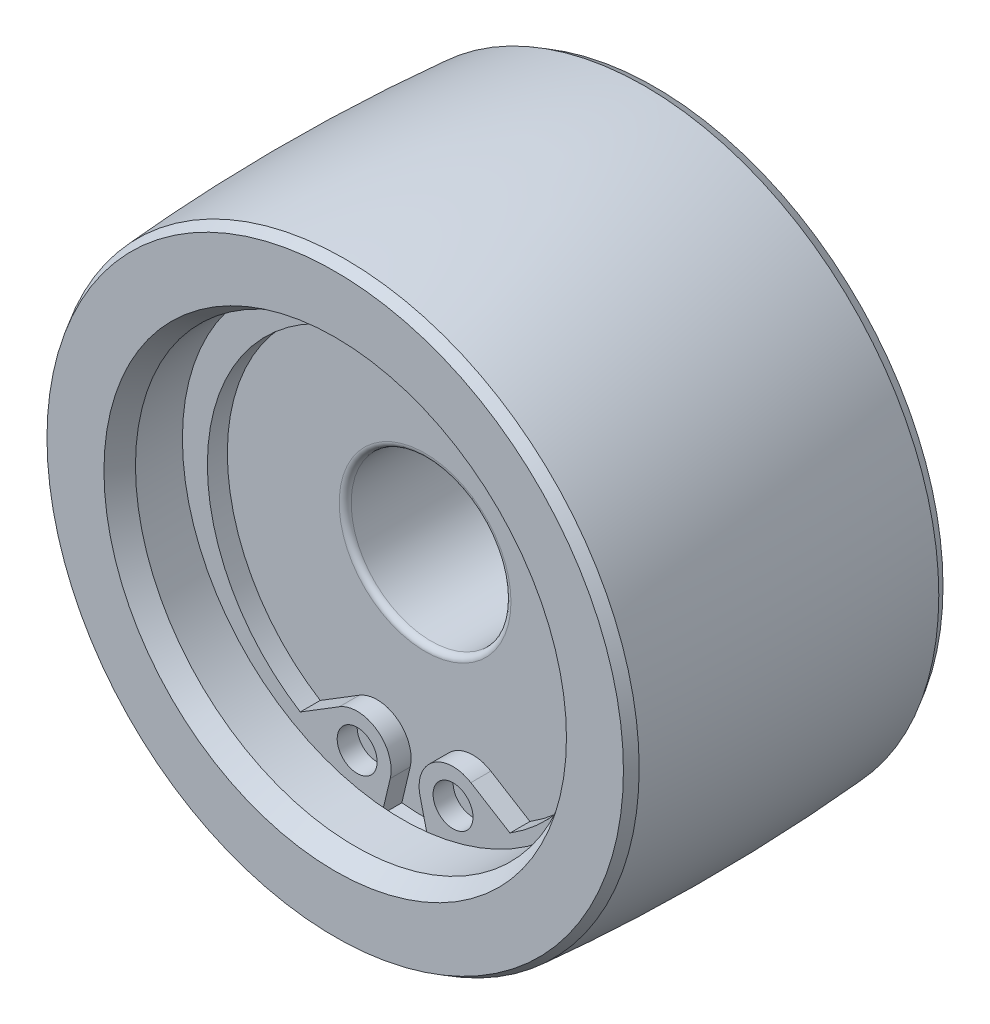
ISO-10303-21;
HEADER;
FILE_DESCRIPTION(('STEP AP214'),'2;1');
FILE_NAME('part.step','',(''),(''),'','','');
FILE_SCHEMA(('AUTOMOTIVE_DESIGN { 1 0 10303 214 1 1 1 1 }'));
ENDSEC;
DATA;
#1=APPLICATION_CONTEXT('core data for automotive mechanical design processes');
#2=APPLICATION_PROTOCOL_DEFINITION('international standard','automotive_design',2000,#1);
#3=PRODUCT_CONTEXT('',#1,'mechanical');
#4=PRODUCT('Part','Part','',(#3));
#5=PRODUCT_RELATED_PRODUCT_CATEGORY('part','',(#4));
#6=PRODUCT_DEFINITION_FORMATION('','',#4);
#7=PRODUCT_DEFINITION_CONTEXT('part definition',#1,'design');
#8=PRODUCT_DEFINITION('design','',#6,#7);
#9=PRODUCT_DEFINITION_SHAPE('','',#8);
#10=(LENGTH_UNIT() NAMED_UNIT(*) SI_UNIT(.MILLI.,.METRE.));
#11=(NAMED_UNIT(*) PLANE_ANGLE_UNIT() SI_UNIT($,.RADIAN.));
#12=(NAMED_UNIT(*) SI_UNIT($,.STERADIAN.) SOLID_ANGLE_UNIT());
#13=UNCERTAINTY_MEASURE_WITH_UNIT(LENGTH_MEASURE(1.E-05),#10,'distance_accuracy_value','');
#14=(GEOMETRIC_REPRESENTATION_CONTEXT(3) GLOBAL_UNCERTAINTY_ASSIGNED_CONTEXT((#13)) GLOBAL_UNIT_ASSIGNED_CONTEXT((#10,
#11,#12)) REPRESENTATION_CONTEXT('',''));
#15=CARTESIAN_POINT('',(0.,0.,0.));
#16=DIRECTION('',(0.,0.,1.));
#17=DIRECTION('',(1.,0.,0.));
#18=AXIS2_PLACEMENT_3D('',#15,#16,#17);
#19=CARTESIAN_POINT('',(0.,0.,-6.9999999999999));
#20=DIRECTION('',(0.,0.,1.));
#21=DIRECTION('',(1.,0.,0.));
#22=AXIS2_PLACEMENT_3D('',#19,#20,#21);
#23=CONICAL_SURFACE('',#22,15.0070285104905,0.523598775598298);
#24=CARTESIAN_POINT('',(0.,0.,-7.9999999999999));
#25=DIRECTION('',(0.,0.,-1.));
#26=DIRECTION('',(-1.,0.,0.));
#27=AXIS2_PLACEMENT_3D('',#24,#25,#26);
#28=CIRCLE('',#27,14.4296782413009);
#29=CARTESIAN_POINT('',(-14.4296782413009,0.,-7.9999999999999));
#30=VERTEX_POINT('',#29);
#31=EDGE_CURVE('E197',#30,#30,#28,.T.);
#32=ORIENTED_EDGE('',*,*,#31,.F.);
#33=EDGE_LOOP('',(#32));
#34=FACE_BOUND('',#33,.T.);
#35=CARTESIAN_POINT('',(0.,0.,-7.49999999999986));
#36=DIRECTION('',(0.,0.,-1.));
#37=DIRECTION('',(-1.,0.,0.));
#38=AXIS2_PLACEMENT_3D('',#35,#36,#37);
#39=CIRCLE('',#38,14.7183533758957);
#40=CARTESIAN_POINT('',(-14.7183533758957,0.,-7.49999999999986));
#41=VERTEX_POINT('',#40);
#42=EDGE_CURVE('E200',#41,#41,#39,.F.);
#43=ORIENTED_EDGE('',*,*,#42,.F.);
#44=EDGE_LOOP('',(#43));
#45=FACE_BOUND('',#44,.T.);
#46=ADVANCED_FACE('F14',(#34,#45),#23,.T.);
#47=CARTESIAN_POINT('',(0.,0.,-8.));
#48=DIRECTION('',(0.,0.,1.));
#49=DIRECTION('',(1.,0.,0.));
#50=AXIS2_PLACEMENT_3D('',#47,#48,#49);
#51=PLANE('',#50);
#52=ORIENTED_EDGE('',*,*,#31,.T.);
#53=EDGE_LOOP('',(#52));
#54=FACE_BOUND('',#53,.T.);
#55=CARTESIAN_POINT('',(0.,0.,-8.));
#56=DIRECTION('',(0.,0.,-1.));
#57=DIRECTION('',(-1.,0.,0.));
#58=AXIS2_PLACEMENT_3D('',#55,#56,#57);
#59=CIRCLE('',#58,9.);
#60=CARTESIAN_POINT('',(-9.,0.,-8.));
#61=VERTEX_POINT('',#60);
#62=EDGE_CURVE('E220',#61,#61,#59,.T.);
#63=ORIENTED_EDGE('',*,*,#62,.F.);
#64=EDGE_LOOP('',(#63));
#65=FACE_BOUND('',#64,.T.);
#66=ADVANCED_FACE('F234',(#54,#65),#51,.F.);
#67=CARTESIAN_POINT('',(0.,0.,0.));
#68=DIRECTION('',(0.,0.,-1.));
#69=DIRECTION('',(-1.,0.,0.));
#70=AXIS2_PLACEMENT_3D('',#67,#68,#69);
#71=DEGENERATE_TOROIDAL_SURFACE('',#70,85.,100.,.F.);
#72=ORIENTED_EDGE('',*,*,#42,.T.);
#73=EDGE_LOOP('',(#72));
#74=FACE_BOUND('',#73,.T.);
#75=CARTESIAN_POINT('',(0.,0.,7.5));
#76=DIRECTION('',(0.,0.,1.));
#77=DIRECTION('',(1.,0.,0.));
#78=AXIS2_PLACEMENT_3D('',#75,#76,#77);
#79=CIRCLE('',#78,14.7183533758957);
#80=CARTESIAN_POINT('',(14.7183533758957,0.,7.5));
#81=VERTEX_POINT('',#80);
#82=EDGE_CURVE('E204',#81,#81,#79,.F.);
#83=ORIENTED_EDGE('',*,*,#82,.T.);
#84=EDGE_LOOP('',(#83));
#85=FACE_BOUND('',#84,.T.);
#86=ADVANCED_FACE('F230',(#74,#85),#71,.F.);
#87=CARTESIAN_POINT('',(0.,0.,-8.8));
#88=DIRECTION('',(0.,0.,-1.));
#89=DIRECTION('',(-1.,0.,0.));
#90=AXIS2_PLACEMENT_3D('',#87,#88,#89);
#91=CYLINDRICAL_SURFACE('',#90,9.);
#92=CARTESIAN_POINT('',(0.,0.,-3.5));
#93=DIRECTION('',(0.,0.,-1.));
#94=DIRECTION('',(-1.,0.,0.));
#95=AXIS2_PLACEMENT_3D('',#92,#93,#94);
#96=CIRCLE('',#95,9.);
#97=CARTESIAN_POINT('',(-9.,0.,-3.5));
#98=VERTEX_POINT('',#97);
#99=EDGE_CURVE('E130',#98,#98,#96,.T.);
#100=ORIENTED_EDGE('',*,*,#99,.F.);
#101=EDGE_LOOP('',(#100));
#102=FACE_BOUND('',#101,.T.);
#103=ORIENTED_EDGE('',*,*,#62,.T.);
#104=EDGE_LOOP('',(#103));
#105=FACE_BOUND('',#104,.T.);
#106=ADVANCED_FACE('F508',(#102,#105),#91,.F.);
#107=CARTESIAN_POINT('',(0.,0.,8.));
#108=DIRECTION('',(0.,0.,-1.));
#109=DIRECTION('',(-1.,0.,0.));
#110=AXIS2_PLACEMENT_3D('',#107,#108,#109);
#111=CONICAL_SURFACE('',#110,14.4296782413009,0.523598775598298);
#112=CARTESIAN_POINT('',(0.,0.,8.));
#113=DIRECTION('',(0.,0.,-1.));
#114=DIRECTION('',(-1.,0.,0.));
#115=AXIS2_PLACEMENT_3D('',#112,#113,#114);
#116=CIRCLE('',#115,14.4296782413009);
#117=CARTESIAN_POINT('',(-14.4296782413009,0.,8.));
#118=VERTEX_POINT('',#117);
#119=EDGE_CURVE('E201',#118,#118,#116,.T.);
#120=ORIENTED_EDGE('',*,*,#119,.T.);
#121=EDGE_LOOP('',(#120));
#122=FACE_BOUND('',#121,.T.);
#123=ORIENTED_EDGE('',*,*,#82,.F.);
#124=EDGE_LOOP('',(#123));
#125=FACE_BOUND('',#124,.T.);
#126=ADVANCED_FACE('F289',(#122,#125),#111,.T.);
#127=CARTESIAN_POINT('',(0.,4.9085760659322,-3.50000000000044));
#128=DIRECTION('',(0.,0.,-1.));
#129=DIRECTION('',(-1.,0.,0.));
#130=AXIS2_PLACEMENT_3D('',#127,#128,#129);
#131=PLANE('',#130);
#132=CARTESIAN_POINT('',(0.,0.,-3.50000000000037));
#133=DIRECTION('',(0.,0.,1.));
#134=DIRECTION('',(1.,0.,0.));
#135=AXIS2_PLACEMENT_3D('',#132,#133,#134);
#136=CIRCLE('',#135,4.3);
#137=CARTESIAN_POINT('',(4.3,0.,-3.50000000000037));
#138=VERTEX_POINT('',#137);
#139=EDGE_CURVE('E188',#138,#138,#136,.T.);
#140=ORIENTED_EDGE('',*,*,#139,.T.);
#141=EDGE_LOOP('',(#140));
#142=FACE_BOUND('',#141,.T.);
#143=ORIENTED_EDGE('',*,*,#99,.T.);
#144=EDGE_LOOP('',(#143));
#145=FACE_BOUND('',#144,.T.);
#146=ADVANCED_FACE('F285',(#142,#145),#131,.T.);
#147=CARTESIAN_POINT('',(0.,0.,8.));
#148=DIRECTION('',(0.,0.,1.));
#149=DIRECTION('',(1.,0.,0.));
#150=AXIS2_PLACEMENT_3D('',#147,#148,#149);
#151=PLANE('',#150);
#152=ORIENTED_EDGE('',*,*,#119,.F.);
#153=EDGE_LOOP('',(#152));
#154=FACE_BOUND('',#153,.T.);
#155=CARTESIAN_POINT('',(0.,0.,8.));
#156=DIRECTION('',(0.,0.,-1.));
#157=DIRECTION('',(-1.,0.,0.));
#158=AXIS2_PLACEMENT_3D('',#155,#156,#157);
#159=CIRCLE('',#158,11.5773502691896);
#160=CARTESIAN_POINT('',(-11.5773502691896,0.,8.));
#161=VERTEX_POINT('',#160);
#162=EDGE_CURVE('E205',#161,#161,#159,.T.);
#163=ORIENTED_EDGE('',*,*,#162,.T.);
#164=EDGE_LOOP('',(#163));
#165=FACE_BOUND('',#164,.T.);
#166=ADVANCED_FACE('F288',(#154,#165),#151,.T.);
#167=CARTESIAN_POINT('',(0.,0.,-3.2000000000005));
#168=DIRECTION('',(0.,0.,1.));
#169=DIRECTION('',(1.,0.,0.));
#170=AXIS2_PLACEMENT_3D('',#167,#168,#169);
#171=TOROIDAL_SURFACE('',#170,4.3,0.299999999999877);
#172=ORIENTED_EDGE('',*,*,#139,.F.);
#173=EDGE_LOOP('',(#172));
#174=FACE_BOUND('',#173,.T.);
#175=CARTESIAN_POINT('',(0.,0.,-3.20000000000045));
#176=DIRECTION('',(0.,0.,1.));
#177=DIRECTION('',(1.,0.,0.));
#178=AXIS2_PLACEMENT_3D('',#175,#176,#177);
#179=CIRCLE('',#178,4.00000000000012);
#180=CARTESIAN_POINT('',(4.00000000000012,0.,-3.20000000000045));
#181=VERTEX_POINT('',#180);
#182=EDGE_CURVE('E191',#181,#181,#179,.T.);
#183=ORIENTED_EDGE('',*,*,#182,.T.);
#184=EDGE_LOOP('',(#183));
#185=FACE_BOUND('',#184,.T.);
#186=ADVANCED_FACE('F291',(#174,#185),#171,.T.);
#187=CARTESIAN_POINT('',(0.,0.,7.));
#188=DIRECTION('',(0.,0.,1.));
#189=DIRECTION('',(1.,0.,0.));
#190=AXIS2_PLACEMENT_3D('',#187,#188,#189);
#191=CONICAL_SURFACE('',#190,11.,0.523598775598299);
#192=ORIENTED_EDGE('',*,*,#162,.F.);
#193=EDGE_LOOP('',(#192));
#194=FACE_BOUND('',#193,.T.);
#195=CARTESIAN_POINT('',(0.,0.,7.));
#196=DIRECTION('',(0.,0.,-1.));
#197=DIRECTION('',(-1.,0.,0.));
#198=AXIS2_PLACEMENT_3D('',#195,#196,#197);
#199=CIRCLE('',#198,11.);
#200=CARTESIAN_POINT('',(-11.,0.,7.));
#201=VERTEX_POINT('',#200);
#202=EDGE_CURVE('E208',#201,#201,#199,.T.);
#203=ORIENTED_EDGE('',*,*,#202,.T.);
#204=EDGE_LOOP('',(#203));
#205=FACE_BOUND('',#204,.T.);
#206=ADVANCED_FACE('F294',(#194,#205),#191,.F.);
#207=CARTESIAN_POINT('',(0.,0.,-46.5));
#208=DIRECTION('',(0.,0.,1.));
#209=DIRECTION('',(1.,0.,0.));
#210=AXIS2_PLACEMENT_3D('',#207,#208,#209);
#211=CYLINDRICAL_SURFACE('',#210,4.00000000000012);
#212=ORIENTED_EDGE('',*,*,#182,.F.);
#213=EDGE_LOOP('',(#212));
#214=FACE_BOUND('',#213,.T.);
#215=CARTESIAN_POINT('',(0.,0.,3.19999999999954));
#216=DIRECTION('',(0.,0.,1.));
#217=DIRECTION('',(1.,0.,0.));
#218=AXIS2_PLACEMENT_3D('',#215,#216,#217);
#219=CIRCLE('',#218,4.00000000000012);
#220=CARTESIAN_POINT('',(4.00000000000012,0.,3.19999999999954));
#221=VERTEX_POINT('',#220);
#222=EDGE_CURVE('E194',#221,#221,#219,.T.);
#223=ORIENTED_EDGE('',*,*,#222,.T.);
#224=EDGE_LOOP('',(#223));
#225=FACE_BOUND('',#224,.T.);
#226=ADVANCED_FACE('F296',(#214,#225),#211,.F.);
#227=CARTESIAN_POINT('',(0.,0.,-8.8));
#228=DIRECTION('',(0.,0.,-1.));
#229=DIRECTION('',(-1.,0.,0.));
#230=AXIS2_PLACEMENT_3D('',#227,#228,#229);
#231=CYLINDRICAL_SURFACE('',#230,11.);
#232=ORIENTED_EDGE('',*,*,#202,.F.);
#233=EDGE_LOOP('',(#232));
#234=FACE_BOUND('',#233,.T.);
#235=CARTESIAN_POINT('',(0.,0.,4.65));
#236=DIRECTION('',(0.,0.,-1.));
#237=DIRECTION('',(-1.,0.,0.));
#238=AXIS2_PLACEMENT_3D('',#235,#236,#237);
#239=CIRCLE('',#238,11.);
#240=CARTESIAN_POINT('',(-11.,0.,4.65));
#241=VERTEX_POINT('',#240);
#242=EDGE_CURVE('E211',#241,#241,#239,.T.);
#243=ORIENTED_EDGE('',*,*,#242,.T.);
#244=EDGE_LOOP('',(#243));
#245=FACE_BOUND('',#244,.T.);
#246=ADVANCED_FACE('F298',(#234,#245),#231,.F.);
#247=CARTESIAN_POINT('',(0.,0.,3.19999999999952));
#248=DIRECTION('',(0.,0.,1.));
#249=DIRECTION('',(1.,0.,0.));
#250=AXIS2_PLACEMENT_3D('',#247,#248,#249);
#251=TOROIDAL_SURFACE('',#250,4.30000000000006,0.299999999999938);
#252=ORIENTED_EDGE('',*,*,#222,.F.);
#253=EDGE_LOOP('',(#252));
#254=FACE_BOUND('',#253,.T.);
#255=CARTESIAN_POINT('',(0.,0.,3.49999999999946));
#256=DIRECTION('',(0.,0.,1.));
#257=DIRECTION('',(1.,0.,0.));
#258=AXIS2_PLACEMENT_3D('',#255,#256,#257);
#259=CIRCLE('',#258,4.30000000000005);
#260=CARTESIAN_POINT('',(4.30000000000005,0.,3.49999999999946));
#261=VERTEX_POINT('',#260);
#262=EDGE_CURVE('E185',#261,#261,#259,.T.);
#263=ORIENTED_EDGE('',*,*,#262,.T.);
#264=EDGE_LOOP('',(#263));
#265=FACE_BOUND('',#264,.T.);
#266=ADVANCED_FACE('F283',(#254,#265),#251,.T.);
#267=CARTESIAN_POINT('',(0.,12.8587498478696,3.5));
#268=DIRECTION('',(0.,0.,1.));
#269=DIRECTION('',(1.,0.,0.));
#270=AXIS2_PLACEMENT_3D('',#267,#268,#269);
#271=PLANE('',#270);
#272=ORIENTED_EDGE('',*,*,#262,.F.);
#273=EDGE_LOOP('',(#272));
#274=FACE_BOUND('',#273,.T.);
#275=CARTESIAN_POINT('',(0.,0.,3.5));
#276=DIRECTION('',(0.,0.,-1.));
#277=DIRECTION('',(-1.,0.,0.));
#278=AXIS2_PLACEMENT_3D('',#275,#276,#277);
#279=CIRCLE('',#278,11.5);
#280=CARTESIAN_POINT('',(1.16498191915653,-11.440839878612,3.5));
#281=VERTEX_POINT('',#280);
#282=CARTESIAN_POINT('',(-1.16498191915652,-11.440839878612,3.5));
#283=VERTEX_POINT('',#282);
#284=EDGE_CURVE('E217',#281,#283,#279,.T.);
#285=ORIENTED_EDGE('',*,*,#284,.F.);
#286=DIRECTION('',(-0.231349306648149,0.972870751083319,0.));
#287=VECTOR('',#286,1.);
#288=CARTESIAN_POINT('',(-4.3665517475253,11.820380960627,3.5));
#289=LINE('',#288,#287);
#290=CARTESIAN_POINT('',(0.746119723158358,-9.67943940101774,3.5));
#291=VERTEX_POINT('',#290);
#292=EDGE_CURVE('E9',#281,#291,#289,.T.);
#293=ORIENTED_EDGE('',*,*,#292,.T.);
#294=CARTESIAN_POINT('',(2.4,-9.28614557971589,3.5));
#295=DIRECTION('',(0.,0.,1.));
#296=DIRECTION('',(1.,0.,0.));
#297=AXIS2_PLACEMENT_3D('',#294,#295,#296);
#298=CIRCLE('',#297,1.7);
#299=CARTESIAN_POINT('',(3.29136923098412,-7.83857489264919,3.5));
#300=VERTEX_POINT('',#299);
#301=EDGE_CURVE('E25',#300,#291,#298,.T.);
#302=ORIENTED_EDGE('',*,*,#301,.F.);
#303=DIRECTION('',(0.851512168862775,-0.524334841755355,0.));
#304=VECTOR('',#303,1.);
#305=CARTESIAN_POINT('',(-8.33600341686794,-0.678798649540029,3.5));
#306=LINE('',#305,#304);
#307=CARTESIAN_POINT('',(5.24892182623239,-9.04397520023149,3.5));
#308=VERTEX_POINT('',#307);
#309=EDGE_CURVE('E157',#300,#308,#306,.T.);
#310=ORIENTED_EDGE('',*,*,#309,.T.);
#311=CARTESIAN_POINT('',(0.,-0.65,3.5));
#312=DIRECTION('',(0.,0.,1.));
#313=DIRECTION('',(1.,0.,0.));
#314=AXIS2_PLACEMENT_3D('',#311,#312,#313);
#315=CIRCLE('',#314,9.9);
#316=CARTESIAN_POINT('',(-5.24892182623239,-9.04397520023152,3.5));
#317=VERTEX_POINT('',#316);
#318=EDGE_CURVE('E161',#308,#317,#315,.T.);
#319=ORIENTED_EDGE('',*,*,#318,.T.);
#320=DIRECTION('',(0.851512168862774,0.524334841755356,0.));
#321=VECTOR('',#320,1.);
#322=CARTESIAN_POINT('',(8.33600341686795,-0.678798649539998,3.5));
#323=LINE('',#322,#321);
#324=CARTESIAN_POINT('',(-3.29136923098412,-7.83857489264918,3.5));
#325=VERTEX_POINT('',#324);
#326=EDGE_CURVE('E165',#317,#325,#323,.T.);
#327=ORIENTED_EDGE('',*,*,#326,.T.);
#328=CARTESIAN_POINT('',(-2.4,-9.28614557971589,3.5));
#329=DIRECTION('',(0.,0.,1.));
#330=DIRECTION('',(1.,0.,0.));
#331=AXIS2_PLACEMENT_3D('',#328,#329,#330);
#332=CIRCLE('',#331,1.7);
#333=CARTESIAN_POINT('',(-0.746119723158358,-9.67943940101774,3.5));
#334=VERTEX_POINT('',#333);
#335=EDGE_CURVE('E170',#334,#325,#332,.T.);
#336=ORIENTED_EDGE('',*,*,#335,.F.);
#337=DIRECTION('',(-0.231349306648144,-0.97287075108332,0.));
#338=VECTOR('',#337,1.);
#339=CARTESIAN_POINT('',(4.36655174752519,11.8203809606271,3.5));
#340=LINE('',#339,#338);
#341=EDGE_CURVE('E104',#334,#283,#340,.T.);
#342=ORIENTED_EDGE('',*,*,#341,.T.);
#343=EDGE_LOOP('',(#285,#293,#302,#310,#319,#327,#336,#342));
#344=FACE_BOUND('',#343,.T.);
#345=ADVANCED_FACE('F261',(#274,#344),#271,.T.);
#346=CARTESIAN_POINT('',(0.,11.,4.65));
#347=DIRECTION('',(0.,0.,1.));
#348=DIRECTION('',(1.,0.,0.));
#349=AXIS2_PLACEMENT_3D('',#346,#347,#348);
#350=PLANE('',#349);
#351=ORIENTED_EDGE('',*,*,#242,.F.);
#352=EDGE_LOOP('',(#351));
#353=FACE_BOUND('',#352,.T.);
#354=CARTESIAN_POINT('',(0.,0.,4.65));
#355=DIRECTION('',(0.,0.,-1.));
#356=DIRECTION('',(-1.,0.,0.));
#357=AXIS2_PLACEMENT_3D('',#354,#355,#356);
#358=CIRCLE('',#357,11.5);
#359=CARTESIAN_POINT('',(-11.5,0.,4.65));
#360=VERTEX_POINT('',#359);
#361=EDGE_CURVE('E214',#360,#360,#358,.T.);
#362=ORIENTED_EDGE('',*,*,#361,.T.);
#363=EDGE_LOOP('',(#362));
#364=FACE_BOUND('',#363,.T.);
#365=ADVANCED_FACE('F282',(#353,#364),#350,.F.);
#366=CARTESIAN_POINT('',(0.,0.,-8.8));
#367=DIRECTION('',(0.,0.,-1.));
#368=DIRECTION('',(-1.,0.,0.));
#369=AXIS2_PLACEMENT_3D('',#366,#367,#368);
#370=CYLINDRICAL_SURFACE('',#369,11.5);
#371=ORIENTED_EDGE('',*,*,#361,.F.);
#372=EDGE_LOOP('',(#371));
#373=FACE_BOUND('',#372,.T.);
#374=DIRECTION('',(0.,0.,-1.));
#375=VECTOR('',#374,1.);
#376=CARTESIAN_POINT('',(1.16498191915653,-11.440839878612,-8.8));
#377=LINE('',#376,#375);
#378=CARTESIAN_POINT('',(1.16498191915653,-11.440839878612,4.5));
#379=VERTEX_POINT('',#378);
#380=EDGE_CURVE('E180',#281,#379,#377,.F.);
#381=ORIENTED_EDGE('',*,*,#380,.F.);
#382=ORIENTED_EDGE('',*,*,#284,.T.);
#383=DIRECTION('',(0.,0.,-1.));
#384=VECTOR('',#383,1.);
#385=CARTESIAN_POINT('',(-1.16498191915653,-11.440839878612,-8.8));
#386=LINE('',#385,#384);
#387=CARTESIAN_POINT('',(-1.16498191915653,-11.440839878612,4.5));
#388=VERTEX_POINT('',#387);
#389=EDGE_CURVE('E183',#388,#283,#386,.T.);
#390=ORIENTED_EDGE('',*,*,#389,.F.);
#391=CARTESIAN_POINT('',(0.,0.,4.5));
#392=DIRECTION('',(0.,0.,-1.));
#393=DIRECTION('',(-1.,0.,0.));
#394=AXIS2_PLACEMENT_3D('',#391,#392,#393);
#395=CIRCLE('',#394,11.5);
#396=EDGE_CURVE('E83',#379,#388,#395,.F.);
#397=ORIENTED_EDGE('',*,*,#396,.F.);
#398=EDGE_LOOP('',(#381,#382,#390,#397));
#399=FACE_BOUND('',#398,.T.);
#400=ADVANCED_FACE('F319',(#373,#399),#370,.F.);
#401=CARTESIAN_POINT('',(2.4,-9.28614557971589,3.5));
#402=DIRECTION('',(0.,0.,1.));
#403=DIRECTION('',(1.,0.,0.));
#404=AXIS2_PLACEMENT_3D('',#401,#402,#403);
#405=CIRCLE('',#404,1.);
#406=CARTESIAN_POINT('',(3.4,-9.28614557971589,3.5));
#407=VERTEX_POINT('',#406);
#408=EDGE_CURVE('E177',#407,#407,#405,.T.);
#409=ORIENTED_EDGE('',*,*,#408,.T.);
#410=EDGE_LOOP('',(#409));
#411=FACE_BOUND('',#410,.T.);
#412=ADVANCED_FACE('F258',(#411),#271,.T.);
#413=CARTESIAN_POINT('',(-2.4,-9.28614557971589,3.5));
#414=DIRECTION('',(0.,0.,1.));
#415=DIRECTION('',(1.,0.,0.));
#416=AXIS2_PLACEMENT_3D('',#413,#414,#415);
#417=CIRCLE('',#416,1.);
#418=CARTESIAN_POINT('',(-1.4,-9.28614557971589,3.5));
#419=VERTEX_POINT('',#418);
#420=EDGE_CURVE('E173',#419,#419,#417,.T.);
#421=ORIENTED_EDGE('',*,*,#420,.T.);
#422=EDGE_LOOP('',(#421));
#423=FACE_BOUND('',#422,.T.);
#424=ADVANCED_FACE('F252',(#423),#271,.T.);
#425=CARTESIAN_POINT('',(3.29136923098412,-7.83857489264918,4.5));
#426=DIRECTION('',(-0.524334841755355,-0.851512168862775,0.));
#427=DIRECTION('',(-0.851512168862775,0.524334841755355,0.));
#428=AXIS2_PLACEMENT_3D('',#425,#426,#427);
#429=PLANE('',#428);
#430=ORIENTED_EDGE('',*,*,#309,.F.);
#431=DIRECTION('',(0.,0.,-1.));
#432=VECTOR('',#431,1.);
#433=CARTESIAN_POINT('',(3.29136923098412,-7.83857489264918,4.5));
#434=LINE('',#433,#432);
#435=CARTESIAN_POINT('',(3.29136923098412,-7.83857489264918,4.5));
#436=VERTEX_POINT('',#435);
#437=EDGE_CURVE('E112',#436,#300,#434,.T.);
#438=ORIENTED_EDGE('',*,*,#437,.F.);
#439=DIRECTION('',(-0.851512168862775,0.524334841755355,0.));
#440=VECTOR('',#439,1.);
#441=CARTESIAN_POINT('',(3.29136923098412,-7.83857489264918,4.5));
#442=LINE('',#441,#440);
#443=CARTESIAN_POINT('',(5.2489218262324,-9.04397520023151,4.5));
#444=VERTEX_POINT('',#443);
#445=EDGE_CURVE('E117',#444,#436,#442,.T.);
#446=ORIENTED_EDGE('',*,*,#445,.F.);
#447=DIRECTION('',(0.,0.,-1.));
#448=VECTOR('',#447,1.);
#449=CARTESIAN_POINT('',(5.2489218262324,-9.04397520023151,4.5));
#450=LINE('',#449,#448);
#451=EDGE_CURVE('E18',#444,#308,#450,.T.);
#452=ORIENTED_EDGE('',*,*,#451,.T.);
#453=EDGE_LOOP('',(#430,#438,#446,#452));
#454=FACE_BOUND('',#453,.T.);
#455=ADVANCED_FACE('F249',(#454),#429,.F.);
#456=CARTESIAN_POINT('',(0.,-0.65,4.5));
#457=DIRECTION('',(0.,0.,1.));
#458=DIRECTION('',(-1.,0.,0.));
#459=AXIS2_PLACEMENT_3D('',#456,#457,#458);
#460=CYLINDRICAL_SURFACE('',#459,9.9);
#461=ORIENTED_EDGE('',*,*,#318,.F.);
#462=ORIENTED_EDGE('',*,*,#451,.F.);
#463=CARTESIAN_POINT('',(0.,-0.65,4.5));
#464=DIRECTION('',(0.,0.,-1.));
#465=DIRECTION('',(0.,-1.,0.));
#466=AXIS2_PLACEMENT_3D('',#463,#464,#465);
#467=CIRCLE('',#466,9.9);
#468=CARTESIAN_POINT('',(-5.24892182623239,-9.04397520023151,4.5));
#469=VERTEX_POINT('',#468);
#470=EDGE_CURVE('E124',#469,#444,#467,.T.);
#471=ORIENTED_EDGE('',*,*,#470,.F.);
#472=DIRECTION('',(0.,0.,-1.));
#473=VECTOR('',#472,1.);
#474=CARTESIAN_POINT('',(-5.24892182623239,-9.04397520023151,4.5));
#475=LINE('',#474,#473);
#476=EDGE_CURVE('E131',#469,#317,#475,.T.);
#477=ORIENTED_EDGE('',*,*,#476,.T.);
#478=EDGE_LOOP('',(#461,#462,#471,#477));
#479=FACE_BOUND('',#478,.T.);
#480=ADVANCED_FACE('F251',(#479),#460,.F.);
#481=CARTESIAN_POINT('',(-3.29136923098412,-7.83857489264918,4.5));
#482=DIRECTION('',(0.524334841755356,-0.851512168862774,0.));
#483=DIRECTION('',(0.,0.,-1.));
#484=AXIS2_PLACEMENT_3D('',#481,#482,#483);
#485=PLANE('',#484);
#486=ORIENTED_EDGE('',*,*,#326,.F.);
#487=ORIENTED_EDGE('',*,*,#476,.F.);
#488=DIRECTION('',(-0.851512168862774,-0.524334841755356,0.));
#489=VECTOR('',#488,1.);
#490=CARTESIAN_POINT('',(-3.29136923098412,-7.83857489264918,4.5));
#491=LINE('',#490,#489);
#492=CARTESIAN_POINT('',(-3.29136923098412,-7.83857489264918,4.5));
#493=VERTEX_POINT('',#492);
#494=EDGE_CURVE('E127',#493,#469,#491,.T.);
#495=ORIENTED_EDGE('',*,*,#494,.F.);
#496=DIRECTION('',(0.,0.,-1.));
#497=VECTOR('',#496,1.);
#498=CARTESIAN_POINT('',(-3.29136923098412,-7.83857489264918,4.5));
#499=LINE('',#498,#497);
#500=EDGE_CURVE('E97',#493,#325,#499,.T.);
#501=ORIENTED_EDGE('',*,*,#500,.T.);
#502=EDGE_LOOP('',(#486,#487,#495,#501));
#503=FACE_BOUND('',#502,.T.);
#504=ADVANCED_FACE('F16',(#503),#485,.F.);
#505=CARTESIAN_POINT('',(2.4,-9.28614557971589,4.5));
#506=DIRECTION('',(0.,0.,1.));
#507=DIRECTION('',(-1.,0.,0.));
#508=AXIS2_PLACEMENT_3D('',#505,#506,#507);
#509=CYLINDRICAL_SURFACE('',#508,1.);
#510=ORIENTED_EDGE('',*,*,#408,.F.);
#511=EDGE_LOOP('',(#510));
#512=FACE_BOUND('',#511,.T.);
#513=CARTESIAN_POINT('',(2.4,-9.28614557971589,4.5));
#514=DIRECTION('',(0.,0.,1.));
#515=DIRECTION('',(1.,0.,0.));
#516=AXIS2_PLACEMENT_3D('',#513,#514,#515);
#517=CIRCLE('',#516,1.);
#518=CARTESIAN_POINT('',(3.4,-9.28614557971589,4.5));
#519=VERTEX_POINT('',#518);
#520=EDGE_CURVE('E107',#519,#519,#517,.T.);
#521=ORIENTED_EDGE('',*,*,#520,.T.);
#522=EDGE_LOOP('',(#521));
#523=FACE_BOUND('',#522,.T.);
#524=ADVANCED_FACE('F274',(#512,#523),#509,.F.);
#525=CARTESIAN_POINT('',(-2.4,-9.28614557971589,4.5));
#526=DIRECTION('',(0.,0.,1.));
#527=DIRECTION('',(-1.,0.,0.));
#528=AXIS2_PLACEMENT_3D('',#525,#526,#527);
#529=CYLINDRICAL_SURFACE('',#528,1.);
#530=ORIENTED_EDGE('',*,*,#420,.F.);
#531=EDGE_LOOP('',(#530));
#532=FACE_BOUND('',#531,.T.);
#533=CARTESIAN_POINT('',(-2.4,-9.28614557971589,4.5));
#534=DIRECTION('',(0.,0.,-1.));
#535=DIRECTION('',(1.,0.,0.));
#536=AXIS2_PLACEMENT_3D('',#533,#534,#535);
#537=CIRCLE('',#536,1.);
#538=CARTESIAN_POINT('',(-1.4,-9.28614557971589,4.5));
#539=VERTEX_POINT('',#538);
#540=EDGE_CURVE('E99',#539,#539,#537,.T.);
#541=ORIENTED_EDGE('',*,*,#540,.F.);
#542=EDGE_LOOP('',(#541));
#543=FACE_BOUND('',#542,.T.);
#544=ADVANCED_FACE('F271',(#532,#543),#529,.F.);
#545=CARTESIAN_POINT('',(2.4,-9.28614557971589,4.5));
#546=DIRECTION('',(0.,0.,1.));
#547=DIRECTION('',(-1.,0.,0.));
#548=AXIS2_PLACEMENT_3D('',#545,#546,#547);
#549=CYLINDRICAL_SURFACE('',#548,1.7);
#550=ORIENTED_EDGE('',*,*,#301,.T.);
#551=DIRECTION('',(0.,0.,-1.));
#552=VECTOR('',#551,1.);
#553=CARTESIAN_POINT('',(0.746119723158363,-9.67943940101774,4.5));
#554=LINE('',#553,#552);
#555=CARTESIAN_POINT('',(0.746119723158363,-9.67943940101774,4.5));
#556=VERTEX_POINT('',#555);
#557=EDGE_CURVE('E106',#556,#291,#554,.T.);
#558=ORIENTED_EDGE('',*,*,#557,.F.);
#559=CARTESIAN_POINT('',(2.4,-9.28614557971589,4.5));
#560=DIRECTION('',(0.,0.,1.));
#561=DIRECTION('',(1.,0.,0.));
#562=AXIS2_PLACEMENT_3D('',#559,#560,#561);
#563=CIRCLE('',#562,1.7);
#564=EDGE_CURVE('E121',#436,#556,#563,.T.);
#565=ORIENTED_EDGE('',*,*,#564,.F.);
#566=ORIENTED_EDGE('',*,*,#437,.T.);
#567=EDGE_LOOP('',(#550,#558,#565,#566));
#568=FACE_BOUND('',#567,.T.);
#569=ADVANCED_FACE('F268',(#568),#549,.T.);
#570=CARTESIAN_POINT('',(-2.4,-9.28614557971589,4.5));
#571=DIRECTION('',(0.,0.,1.));
#572=DIRECTION('',(-1.,0.,0.));
#573=AXIS2_PLACEMENT_3D('',#570,#571,#572);
#574=CYLINDRICAL_SURFACE('',#573,1.7);
#575=ORIENTED_EDGE('',*,*,#335,.T.);
#576=ORIENTED_EDGE('',*,*,#500,.F.);
#577=CARTESIAN_POINT('',(-2.4,-9.28614557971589,4.5));
#578=DIRECTION('',(0.,0.,1.));
#579=DIRECTION('',(-1.,0.,0.));
#580=AXIS2_PLACEMENT_3D('',#577,#578,#579);
#581=CIRCLE('',#580,1.7);
#582=CARTESIAN_POINT('',(-0.746119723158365,-9.67943940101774,4.5));
#583=VERTEX_POINT('',#582);
#584=EDGE_CURVE('E80',#583,#493,#581,.T.);
#585=ORIENTED_EDGE('',*,*,#584,.F.);
#586=DIRECTION('',(0.,0.,-1.));
#587=VECTOR('',#586,1.);
#588=CARTESIAN_POINT('',(-0.746119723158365,-9.67943940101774,4.5));
#589=LINE('',#588,#587);
#590=EDGE_CURVE('E95',#583,#334,#589,.T.);
#591=ORIENTED_EDGE('',*,*,#590,.T.);
#592=EDGE_LOOP('',(#575,#576,#585,#591));
#593=FACE_BOUND('',#592,.T.);
#594=ADVANCED_FACE('F93',(#593),#574,.T.);
#595=CARTESIAN_POINT('',(0.,-0.65,4.5));
#596=DIRECTION('',(0.,0.,-1.));
#597=DIRECTION('',(0.,-1.,0.));
#598=AXIS2_PLACEMENT_3D('',#595,#596,#597);
#599=PLANE('',#598);
#600=ORIENTED_EDGE('',*,*,#540,.T.);
#601=EDGE_LOOP('',(#600));
#602=FACE_BOUND('',#601,.T.);
#603=ORIENTED_EDGE('',*,*,#520,.F.);
#604=EDGE_LOOP('',(#603));
#605=FACE_BOUND('',#604,.T.);
#606=DIRECTION('',(0.231349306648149,-0.972870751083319,0.));
#607=VECTOR('',#606,1.);
#608=CARTESIAN_POINT('',(0.746119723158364,-9.67943940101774,4.5));
#609=LINE('',#608,#607);
#610=EDGE_CURVE('E68',#556,#379,#609,.T.);
#611=ORIENTED_EDGE('',*,*,#610,.T.);
#612=ORIENTED_EDGE('',*,*,#396,.T.);
#613=DIRECTION('',(0.231349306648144,0.97287075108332,0.));
#614=VECTOR('',#613,1.);
#615=CARTESIAN_POINT('',(-0.746119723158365,-9.67943940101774,4.5));
#616=LINE('',#615,#614);
#617=EDGE_CURVE('E77',#388,#583,#616,.T.);
#618=ORIENTED_EDGE('',*,*,#617,.T.);
#619=ORIENTED_EDGE('',*,*,#584,.T.);
#620=ORIENTED_EDGE('',*,*,#494,.T.);
#621=ORIENTED_EDGE('',*,*,#470,.T.);
#622=ORIENTED_EDGE('',*,*,#445,.T.);
#623=ORIENTED_EDGE('',*,*,#564,.T.);
#624=EDGE_LOOP('',(#611,#612,#618,#619,#620,#621,#622,#623));
#625=FACE_BOUND('',#624,.T.);
#626=ADVANCED_FACE('F79',(#602,#605,#625),#599,.F.);
#627=CARTESIAN_POINT('',(-0.746119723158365,-9.67943940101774,4.5));
#628=DIRECTION('',(-0.97287075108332,0.231349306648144,0.));
#629=DIRECTION('',(0.,0.,1.));
#630=AXIS2_PLACEMENT_3D('',#627,#628,#629);
#631=PLANE('',#630);
#632=ORIENTED_EDGE('',*,*,#617,.F.);
#633=ORIENTED_EDGE('',*,*,#389,.T.);
#634=ORIENTED_EDGE('',*,*,#341,.F.);
#635=ORIENTED_EDGE('',*,*,#590,.F.);
#636=EDGE_LOOP('',(#632,#633,#634,#635));
#637=FACE_BOUND('',#636,.T.);
#638=ADVANCED_FACE('F102',(#637),#631,.F.);
#639=CARTESIAN_POINT('',(0.746119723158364,-9.67943940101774,4.5));
#640=DIRECTION('',(0.972870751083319,0.231349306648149,0.));
#641=DIRECTION('',(0.,0.,-1.));
#642=AXIS2_PLACEMENT_3D('',#639,#640,#641);
#643=PLANE('',#642);
#644=ORIENTED_EDGE('',*,*,#292,.F.);
#645=ORIENTED_EDGE('',*,*,#380,.T.);
#646=ORIENTED_EDGE('',*,*,#610,.F.);
#647=ORIENTED_EDGE('',*,*,#557,.T.);
#648=EDGE_LOOP('',(#644,#645,#646,#647));
#649=FACE_BOUND('',#648,.T.);
#650=ADVANCED_FACE('F237',(#649),#643,.F.);
#651=CLOSED_SHELL('',(#46,#66,#86,#106,#126,#146,#166,#186,#206,#226,#246,#266,#345,#365,#400,
#412,#424,#455,#480,#504,#524,#544,#569,#594,#626,#638,#650));
#652=MANIFOLD_SOLID_BREP('B1',#651);
#653=ADVANCED_BREP_SHAPE_REPRESENTATION('',(#18,#652),#14);
#654=SHAPE_DEFINITION_REPRESENTATION(#9,#653);
ENDSEC;
END-ISO-10303-21;
